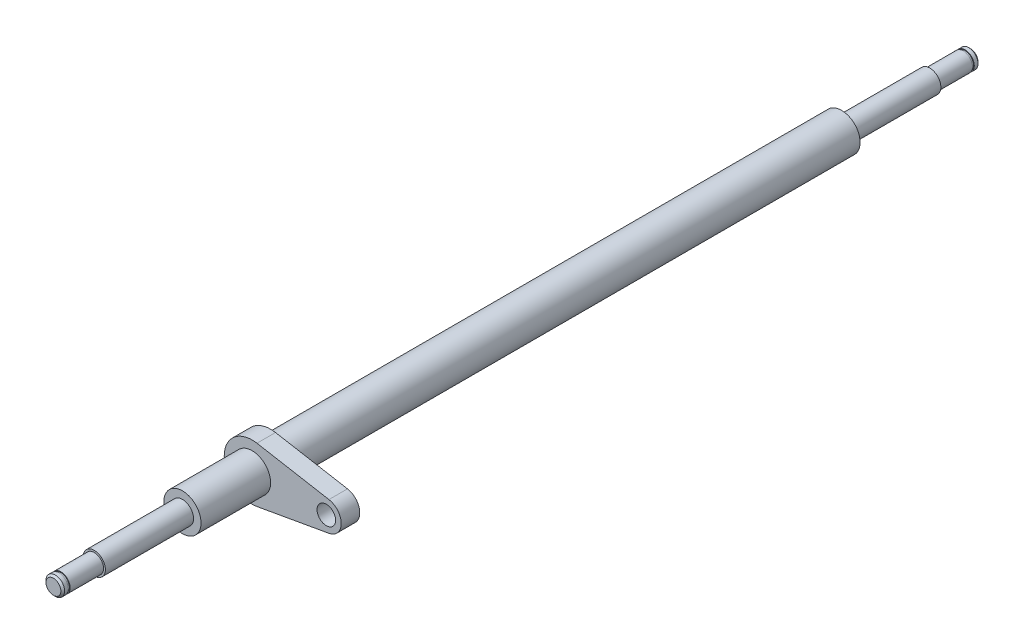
ISO-10303-21;
HEADER;
FILE_DESCRIPTION(('STEP AP214'),'2;1');
FILE_NAME('part.step','',(''),(''),'','','');
FILE_SCHEMA(('AUTOMOTIVE_DESIGN { 1 0 10303 214 1 1 1 1 }'));
ENDSEC;
DATA;
#1=APPLICATION_CONTEXT('core data for automotive mechanical design processes');
#2=APPLICATION_PROTOCOL_DEFINITION('international standard','automotive_design',2000,#1);
#3=PRODUCT_CONTEXT('',#1,'mechanical');
#4=PRODUCT('Part','Part','',(#3));
#5=PRODUCT_RELATED_PRODUCT_CATEGORY('part','',(#4));
#6=PRODUCT_DEFINITION_FORMATION('','',#4);
#7=PRODUCT_DEFINITION_CONTEXT('part definition',#1,'design');
#8=PRODUCT_DEFINITION('design','',#6,#7);
#9=PRODUCT_DEFINITION_SHAPE('','',#8);
#10=(LENGTH_UNIT() NAMED_UNIT(*) SI_UNIT(.MILLI.,.METRE.));
#11=(NAMED_UNIT(*) PLANE_ANGLE_UNIT() SI_UNIT($,.RADIAN.));
#12=(NAMED_UNIT(*) SI_UNIT($,.STERADIAN.) SOLID_ANGLE_UNIT());
#13=UNCERTAINTY_MEASURE_WITH_UNIT(LENGTH_MEASURE(1.E-05),#10,'distance_accuracy_value','');
#14=(GEOMETRIC_REPRESENTATION_CONTEXT(3) GLOBAL_UNCERTAINTY_ASSIGNED_CONTEXT((#13)) GLOBAL_UNIT_ASSIGNED_CONTEXT((#10,
#11,#12)) REPRESENTATION_CONTEXT('',''));
#15=CARTESIAN_POINT('',(0.,0.,0.));
#16=DIRECTION('',(0.,0.,1.));
#17=DIRECTION('',(1.,0.,0.));
#18=AXIS2_PLACEMENT_3D('',#15,#16,#17);
#19=CARTESIAN_POINT('',(0.,0.,140.));
#20=DIRECTION('',(0.,0.,1.));
#21=DIRECTION('',(1.,0.,0.));
#22=AXIS2_PLACEMENT_3D('',#19,#20,#21);
#23=PLANE('',#22);
#24=CARTESIAN_POINT('',(0.,0.,140.));
#25=DIRECTION('',(0.,0.,1.));
#26=DIRECTION('',(1.,0.,0.));
#27=AXIS2_PLACEMENT_3D('',#24,#25,#26);
#28=CIRCLE('',#27,10.);
#29=CARTESIAN_POINT('',(10.,0.,140.));
#30=VERTEX_POINT('',#29);
#31=EDGE_CURVE('E110',#30,#30,#28,.T.);
#32=ORIENTED_EDGE('',*,*,#31,.F.);
#33=EDGE_LOOP('',(#32));
#34=FACE_BOUND('',#33,.T.);
#35=CARTESIAN_POINT('',(0.,0.,140.));
#36=DIRECTION('',(0.,0.,1.));
#37=DIRECTION('',(1.,0.,0.));
#38=AXIS2_PLACEMENT_3D('',#35,#36,#37);
#39=CIRCLE('',#38,15.);
#40=CARTESIAN_POINT('',(2.62499999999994,14.7685265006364,140.));
#41=VERTEX_POINT('',#40);
#42=CARTESIAN_POINT('',(2.62500000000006,-14.7685265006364,140.));
#43=VERTEX_POINT('',#42);
#44=EDGE_CURVE('E95',#41,#43,#39,.T.);
#45=ORIENTED_EDGE('',*,*,#44,.T.);
#46=DIRECTION('',(0.98456843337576,0.175000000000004,0.));
#47=VECTOR('',#46,1.);
#48=CARTESIAN_POINT('',(2.62500000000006,-14.7685265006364,140.));
#49=LINE('',#48,#47);
#50=CARTESIAN_POINT('',(41.4,-7.87654746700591,140.));
#51=VERTEX_POINT('',#50);
#52=EDGE_CURVE('E90',#43,#51,#49,.T.);
#53=ORIENTED_EDGE('',*,*,#52,.T.);
#54=CARTESIAN_POINT('',(40.,1.59594559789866E-13,140.));
#55=DIRECTION('',(0.,0.,1.));
#56=DIRECTION('',(1.,0.,0.));
#57=AXIS2_PLACEMENT_3D('',#54,#55,#56);
#58=CIRCLE('',#57,7.99999999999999);
#59=CARTESIAN_POINT('',(41.4,7.87654746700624,140.));
#60=VERTEX_POINT('',#59);
#61=EDGE_CURVE('E93',#51,#60,#58,.T.);
#62=ORIENTED_EDGE('',*,*,#61,.T.);
#63=DIRECTION('',(-0.984568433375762,0.174999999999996,0.));
#64=VECTOR('',#63,1.);
#65=CARTESIAN_POINT('',(41.4,7.87654746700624,140.));
#66=LINE('',#65,#64);
#67=EDGE_CURVE('E60',#60,#41,#66,.T.);
#68=ORIENTED_EDGE('',*,*,#67,.T.);
#69=EDGE_LOOP('',(#45,#53,#62,#68));
#70=FACE_BOUND('',#69,.T.);
#71=CARTESIAN_POINT('',(40.,1.59594559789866E-13,140.));
#72=DIRECTION('',(0.,0.,1.));
#73=DIRECTION('',(1.,0.,0.));
#74=AXIS2_PLACEMENT_3D('',#71,#72,#73);
#75=CIRCLE('',#74,5.);
#76=CARTESIAN_POINT('',(45.,1.59594559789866E-13,140.));
#77=VERTEX_POINT('',#76);
#78=EDGE_CURVE('E125',#77,#77,#75,.T.);
#79=ORIENTED_EDGE('',*,*,#78,.F.);
#80=EDGE_LOOP('',(#79));
#81=FACE_BOUND('',#80,.T.);
#82=ADVANCED_FACE('F43',(#34,#70,#81),#23,.T.);
#83=CARTESIAN_POINT('',(0.,0.,130.));
#84=DIRECTION('',(0.,0.,1.));
#85=DIRECTION('',(1.,0.,0.));
#86=AXIS2_PLACEMENT_3D('',#83,#84,#85);
#87=PLANE('',#86);
#88=CARTESIAN_POINT('',(0.,0.,130.));
#89=DIRECTION('',(0.,0.,1.));
#90=DIRECTION('',(1.,0.,0.));
#91=AXIS2_PLACEMENT_3D('',#88,#89,#90);
#92=CIRCLE('',#91,10.);
#93=CARTESIAN_POINT('',(10.,0.,130.));
#94=VERTEX_POINT('',#93);
#95=EDGE_CURVE('E122',#94,#94,#92,.T.);
#96=ORIENTED_EDGE('',*,*,#95,.T.);
#97=EDGE_LOOP('',(#96));
#98=FACE_BOUND('',#97,.T.);
#99=CARTESIAN_POINT('',(0.,0.,130.));
#100=DIRECTION('',(0.,0.,1.));
#101=DIRECTION('',(1.,0.,0.));
#102=AXIS2_PLACEMENT_3D('',#99,#100,#101);
#103=CIRCLE('',#102,15.);
#104=CARTESIAN_POINT('',(2.62499999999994,14.7685265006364,130.));
#105=VERTEX_POINT('',#104);
#106=CARTESIAN_POINT('',(2.62500000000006,-14.7685265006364,130.));
#107=VERTEX_POINT('',#106);
#108=EDGE_CURVE('E107',#105,#107,#103,.T.);
#109=ORIENTED_EDGE('',*,*,#108,.F.);
#110=DIRECTION('',(-0.984568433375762,0.174999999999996,0.));
#111=VECTOR('',#110,1.);
#112=CARTESIAN_POINT('',(41.4,7.87654746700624,130.));
#113=LINE('',#112,#111);
#114=CARTESIAN_POINT('',(41.4,7.87654746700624,130.));
#115=VERTEX_POINT('',#114);
#116=EDGE_CURVE('E83',#115,#105,#113,.T.);
#117=ORIENTED_EDGE('',*,*,#116,.F.);
#118=CARTESIAN_POINT('',(40.,1.59594559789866E-13,130.));
#119=DIRECTION('',(0.,0.,1.));
#120=DIRECTION('',(1.,0.,0.));
#121=AXIS2_PLACEMENT_3D('',#118,#119,#120);
#122=CIRCLE('',#121,7.99999999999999);
#123=CARTESIAN_POINT('',(41.4,-7.87654746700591,130.));
#124=VERTEX_POINT('',#123);
#125=EDGE_CURVE('E77',#124,#115,#122,.T.);
#126=ORIENTED_EDGE('',*,*,#125,.F.);
#127=DIRECTION('',(0.98456843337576,0.175000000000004,0.));
#128=VECTOR('',#127,1.);
#129=CARTESIAN_POINT('',(2.62500000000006,-14.7685265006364,130.));
#130=LINE('',#129,#128);
#131=EDGE_CURVE('E99',#107,#124,#130,.T.);
#132=ORIENTED_EDGE('',*,*,#131,.F.);
#133=EDGE_LOOP('',(#109,#117,#126,#132));
#134=FACE_BOUND('',#133,.T.);
#135=CARTESIAN_POINT('',(40.,1.59594559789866E-13,130.));
#136=DIRECTION('',(0.,0.,1.));
#137=DIRECTION('',(1.,0.,0.));
#138=AXIS2_PLACEMENT_3D('',#135,#136,#137);
#139=CIRCLE('',#138,5.);
#140=CARTESIAN_POINT('',(45.,1.59594559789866E-13,130.));
#141=VERTEX_POINT('',#140);
#142=EDGE_CURVE('E128',#141,#141,#139,.T.);
#143=ORIENTED_EDGE('',*,*,#142,.T.);
#144=EDGE_LOOP('',(#143));
#145=FACE_BOUND('',#144,.T.);
#146=ADVANCED_FACE('F118',(#98,#134,#145),#87,.F.);
#147=CARTESIAN_POINT('',(0.,0.,140.));
#148=DIRECTION('',(0.,0.,-1.));
#149=DIRECTION('',(-1.,0.,0.));
#150=AXIS2_PLACEMENT_3D('',#147,#148,#149);
#151=CYLINDRICAL_SURFACE('',#150,15.);
#152=ORIENTED_EDGE('',*,*,#108,.T.);
#153=DIRECTION('',(0.,0.,-1.));
#154=VECTOR('',#153,1.);
#155=CARTESIAN_POINT('',(2.62500000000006,-14.7685265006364,140.));
#156=LINE('',#155,#154);
#157=EDGE_CURVE('E12',#43,#107,#156,.T.);
#158=ORIENTED_EDGE('',*,*,#157,.F.);
#159=ORIENTED_EDGE('',*,*,#44,.F.);
#160=DIRECTION('',(0.,0.,-1.));
#161=VECTOR('',#160,1.);
#162=CARTESIAN_POINT('',(2.62499999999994,14.7685265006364,140.));
#163=LINE('',#162,#161);
#164=EDGE_CURVE('E103',#41,#105,#163,.T.);
#165=ORIENTED_EDGE('',*,*,#164,.T.);
#166=EDGE_LOOP('',(#152,#158,#159,#165));
#167=FACE_BOUND('',#166,.T.);
#168=ADVANCED_FACE('F45',(#167),#151,.T.);
#169=CARTESIAN_POINT('',(2.62500000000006,-14.7685265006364,140.));
#170=DIRECTION('',(-0.175000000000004,0.98456843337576,0.));
#171=DIRECTION('',(-0.98456843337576,-0.175000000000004,0.));
#172=AXIS2_PLACEMENT_3D('',#169,#170,#171);
#173=PLANE('',#172);
#174=ORIENTED_EDGE('',*,*,#131,.T.);
#175=DIRECTION('',(0.,0.,-1.));
#176=VECTOR('',#175,1.);
#177=CARTESIAN_POINT('',(41.4,-7.87654746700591,140.));
#178=LINE('',#177,#176);
#179=EDGE_CURVE('E52',#51,#124,#178,.T.);
#180=ORIENTED_EDGE('',*,*,#179,.F.);
#181=ORIENTED_EDGE('',*,*,#52,.F.);
#182=ORIENTED_EDGE('',*,*,#157,.T.);
#183=EDGE_LOOP('',(#174,#180,#181,#182));
#184=FACE_BOUND('',#183,.T.);
#185=ADVANCED_FACE('F98',(#184),#173,.F.);
#186=CARTESIAN_POINT('',(40.,1.59594559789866E-13,140.));
#187=DIRECTION('',(0.,0.,-1.));
#188=DIRECTION('',(-1.,0.,0.));
#189=AXIS2_PLACEMENT_3D('',#186,#187,#188);
#190=CYLINDRICAL_SURFACE('',#189,7.99999999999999);
#191=ORIENTED_EDGE('',*,*,#125,.T.);
#192=DIRECTION('',(0.,0.,-1.));
#193=VECTOR('',#192,1.);
#194=CARTESIAN_POINT('',(41.4,7.87654746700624,140.));
#195=LINE('',#194,#193);
#196=EDGE_CURVE('E100',#60,#115,#195,.T.);
#197=ORIENTED_EDGE('',*,*,#196,.F.);
#198=ORIENTED_EDGE('',*,*,#61,.F.);
#199=ORIENTED_EDGE('',*,*,#179,.T.);
#200=EDGE_LOOP('',(#191,#197,#198,#199));
#201=FACE_BOUND('',#200,.T.);
#202=ADVANCED_FACE('F101',(#201),#190,.T.);
#203=CARTESIAN_POINT('',(41.4,7.87654746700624,140.));
#204=DIRECTION('',(-0.174999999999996,-0.984568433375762,0.));
#205=DIRECTION('',(0.984568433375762,-0.174999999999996,0.));
#206=AXIS2_PLACEMENT_3D('',#203,#204,#205);
#207=PLANE('',#206);
#208=ORIENTED_EDGE('',*,*,#116,.T.);
#209=ORIENTED_EDGE('',*,*,#164,.F.);
#210=ORIENTED_EDGE('',*,*,#67,.F.);
#211=ORIENTED_EDGE('',*,*,#196,.T.);
#212=EDGE_LOOP('',(#208,#209,#210,#211));
#213=FACE_BOUND('',#212,.T.);
#214=ADVANCED_FACE('F115',(#213),#207,.F.);
#215=CARTESIAN_POINT('',(0.,0.,140.));
#216=DIRECTION('',(0.,0.,-1.));
#217=DIRECTION('',(-1.,0.,0.));
#218=AXIS2_PLACEMENT_3D('',#215,#216,#217);
#219=CYLINDRICAL_SURFACE('',#218,10.);
#220=ORIENTED_EDGE('',*,*,#31,.T.);
#221=EDGE_LOOP('',(#220));
#222=FACE_BOUND('',#221,.T.);
#223=ORIENTED_EDGE('',*,*,#95,.F.);
#224=EDGE_LOOP('',(#223));
#225=FACE_BOUND('',#224,.T.);
#226=ADVANCED_FACE('F146',(#222,#225),#219,.F.);
#227=CARTESIAN_POINT('',(40.,1.59594559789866E-13,140.));
#228=DIRECTION('',(0.,0.,-1.));
#229=DIRECTION('',(-1.,0.,0.));
#230=AXIS2_PLACEMENT_3D('',#227,#228,#229);
#231=CYLINDRICAL_SURFACE('',#230,5.);
#232=ORIENTED_EDGE('',*,*,#78,.T.);
#233=EDGE_LOOP('',(#232));
#234=FACE_BOUND('',#233,.T.);
#235=ORIENTED_EDGE('',*,*,#142,.F.);
#236=EDGE_LOOP('',(#235));
#237=FACE_BOUND('',#236,.T.);
#238=ADVANCED_FACE('F134',(#234,#237),#231,.F.);
#239=CLOSED_SHELL('',(#82,#146,#168,#185,#202,#214,#226,#238));
#240=MANIFOLD_SOLID_BREP('B2',#239);
#241=CARTESIAN_POINT('',(0.,0.,0.));
#242=DIRECTION('',(0.,0.,-1.));
#243=DIRECTION('',(-1.,0.,0.));
#244=AXIS2_PLACEMENT_3D('',#241,#242,#243);
#245=CYLINDRICAL_SURFACE('',#244,4.99999999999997);
#246=CARTESIAN_POINT('',(0.,0.,243.));
#247=DIRECTION('',(0.,0.,-1.));
#248=DIRECTION('',(-1.,0.,0.));
#249=AXIS2_PLACEMENT_3D('',#246,#247,#248);
#250=CIRCLE('',#249,4.99999999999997);
#251=CARTESIAN_POINT('',(-4.99999999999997,0.,243.));
#252=VERTEX_POINT('',#251);
#253=EDGE_CURVE('E416',#252,#252,#250,.T.);
#254=ORIENTED_EDGE('',*,*,#253,.T.);
#255=EDGE_LOOP('',(#254));
#256=FACE_BOUND('',#255,.T.);
#257=CARTESIAN_POINT('',(0.,0.,225.));
#258=DIRECTION('',(0.,0.,-1.));
#259=DIRECTION('',(-1.,0.,0.));
#260=AXIS2_PLACEMENT_3D('',#257,#258,#259);
#261=CIRCLE('',#260,4.99999999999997);
#262=CARTESIAN_POINT('',(-4.99999999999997,0.,225.));
#263=VERTEX_POINT('',#262);
#264=EDGE_CURVE('E412',#263,#263,#261,.T.);
#265=ORIENTED_EDGE('',*,*,#264,.F.);
#266=EDGE_LOOP('',(#265));
#267=FACE_BOUND('',#266,.T.);
#268=DIRECTION('',(0.,0.,-1.));
#269=VECTOR('',#268,1.);
#270=CARTESIAN_POINT('',(-4.58257569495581,-2.,0.));
#271=LINE('',#270,#269);
#272=CARTESIAN_POINT('',(-4.58257569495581,-2.,240.));
#273=VERTEX_POINT('',#272);
#274=CARTESIAN_POINT('',(-4.58257569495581,-2.,228.));
#275=VERTEX_POINT('',#274);
#276=EDGE_CURVE('E217',#273,#275,#271,.T.);
#277=ORIENTED_EDGE('',*,*,#276,.T.);
#278=CARTESIAN_POINT('',(-4.58257569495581,-2.,228.));
#279=CARTESIAN_POINT('',(-4.58256464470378,-2.00000798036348,227.946194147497));
#280=CARTESIAN_POINT('',(-4.5835230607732,-1.99782891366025,227.892394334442));
#281=CARTESIAN_POINT('',(-4.5872962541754,-1.98915905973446,227.785228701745));
#282=CARTESIAN_POINT('',(-4.59011032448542,-1.98266991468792,227.731862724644));
#283=CARTESIAN_POINT('',(-4.59749782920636,-1.9654760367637,227.626153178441));
#284=CARTESIAN_POINT('',(-4.6020643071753,-1.95478796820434,227.573806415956));
#285=CARTESIAN_POINT('',(-4.61280053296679,-1.9293163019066,227.470299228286));
#286=CARTESIAN_POINT('',(-4.61897037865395,-1.9145324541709,227.419138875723));
#287=CARTESIAN_POINT('',(-4.63959291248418,-1.86426971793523,227.268064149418));
#288=CARTESIAN_POINT('',(-4.65617449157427,-1.82284489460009,227.17034576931));
#289=CARTESIAN_POINT('',(-4.69312370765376,-1.72548191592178,226.983204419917));
#290=CARTESIAN_POINT('',(-4.71349493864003,-1.66952996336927,226.893789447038));
#291=CARTESIAN_POINT('',(-4.75700999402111,-1.54131835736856,226.720737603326));
#292=CARTESIAN_POINT('',(-4.78024245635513,-1.46836913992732,226.63763278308));
#293=CARTESIAN_POINT('',(-4.82612790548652,-1.30969646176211,226.484459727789));
#294=CARTESIAN_POINT('',(-4.84878077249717,-1.22397038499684,226.414394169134));
#295=CARTESIAN_POINT('',(-4.89203417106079,-1.03800590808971,226.286593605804));
#296=CARTESIAN_POINT('',(-4.91251824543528,-0.937327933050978,226.229455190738));
#297=CARTESIAN_POINT('',(-4.94803944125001,-0.726824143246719,226.133155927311));
#298=CARTESIAN_POINT('',(-4.96307883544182,-0.617002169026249,226.093987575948));
#299=CARTESIAN_POINT('',(-4.98538314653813,-0.39696744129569,226.036658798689));
#300=CARTESIAN_POINT('',(-4.99298922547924,-0.287031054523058,226.017573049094));
#301=CARTESIAN_POINT('',(-5.00080310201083,-0.065268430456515,225.997971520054));
#302=CARTESIAN_POINT('',(-5.00101352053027,0.0465571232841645,225.997449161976));
#303=CARTESIAN_POINT('',(-4.99421960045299,0.26223337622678,226.01448283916));
#304=CARTESIAN_POINT('',(-4.98761985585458,0.366179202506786,226.031025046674));
#305=CARTESIAN_POINT('',(-4.96849270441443,0.569674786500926,226.079993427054));
#306=CARTESIAN_POINT('',(-4.95596496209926,0.669224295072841,226.112420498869));
#307=CARTESIAN_POINT('',(-4.92596830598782,0.862897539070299,226.192636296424));
#308=CARTESIAN_POINT('',(-4.90842774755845,0.956916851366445,226.24064924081));
#309=CARTESIAN_POINT('',(-4.8701460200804,1.13580746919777,226.350464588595));
#310=CARTESIAN_POINT('',(-4.84940372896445,1.22067554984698,226.412271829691));
#311=CARTESIAN_POINT('',(-4.80521782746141,1.38476339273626,226.552644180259));
#312=CARTESIAN_POINT('',(-4.78168627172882,1.46324770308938,226.63204247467));
#313=CARTESIAN_POINT('',(-4.73561950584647,1.60609926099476,226.802980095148));
#314=CARTESIAN_POINT('',(-4.7130847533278,1.67046007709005,226.894524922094));
#315=CARTESIAN_POINT('',(-4.67095688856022,1.78493657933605,227.090470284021));
#316=CARTESIAN_POINT('',(-4.6514670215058,1.83458932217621,227.19516483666));
#317=CARTESIAN_POINT('',(-4.61886105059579,1.91521298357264,227.412361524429));
#318=CARTESIAN_POINT('',(-4.60573367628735,1.94621696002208,227.524849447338));
#319=CARTESIAN_POINT('',(-4.5920830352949,1.9781058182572,227.698743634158));
#320=CARTESIAN_POINT('',(-4.58853437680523,1.98630505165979,227.758657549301));
#321=CARTESIAN_POINT('',(-4.58377540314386,1.99725282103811,227.879035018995));
#322=CARTESIAN_POINT('',(-4.58256364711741,2.00000471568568,227.939498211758));
#323=CARTESIAN_POINT('',(-4.58257569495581,2.,228.));
#324=B_SPLINE_CURVE_WITH_KNOTS('',3,(#278,#279,#280,#281,#282,#283,#284,#285,#286,#287,#288,
#289,#290,#291,#292,#293,#294,#295,#296,#297,#298,#299,#300,#301,#302,#303,#304,#305,#306,#307,
#308,#309,#310,#311,#312,#313,#314,#315,#316,#317,#318,#319,#320,#321,#322,#323),.UNSPECIFIED.,
.F.,.F.,(4,2,2,2,2,2,2,2,2,2,2,2,2,2,2,2,2,2,2,2,2,2,4),(0.,0.161354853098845,0.322648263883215,
0.483307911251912,0.643977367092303,0.964683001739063,1.28569434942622,1.62318047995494,
1.96073580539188,2.31162858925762,2.66237473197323,2.9961387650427,3.32978451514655,
3.64468915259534,3.95961161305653,4.27928176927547,4.59906421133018,4.93981874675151,
5.28072813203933,5.6314424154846,5.98153315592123,6.16300192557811,6.34435877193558),.UNSPECIFIED.);
#325=CARTESIAN_POINT('',(-4.58257569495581,2.,228.));
#326=VERTEX_POINT('',#325);
#327=EDGE_CURVE('E377',#275,#326,#324,.T.);
#328=ORIENTED_EDGE('',*,*,#327,.T.);
#329=DIRECTION('',(0.,0.,-1.));
#330=VECTOR('',#329,1.);
#331=CARTESIAN_POINT('',(-4.58257569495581,2.,0.));
#332=LINE('',#331,#330);
#333=CARTESIAN_POINT('',(-4.58257569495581,2.,240.));
#334=VERTEX_POINT('',#333);
#335=EDGE_CURVE('E479',#326,#334,#332,.F.);
#336=ORIENTED_EDGE('',*,*,#335,.T.);
#337=CARTESIAN_POINT('',(-4.58257569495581,2.,240.));
#338=CARTESIAN_POINT('',(-4.58256464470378,2.00000798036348,240.053805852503));
#339=CARTESIAN_POINT('',(-4.5835230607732,1.99782891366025,240.107605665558));
#340=CARTESIAN_POINT('',(-4.5872962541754,1.98915905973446,240.214771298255));
#341=CARTESIAN_POINT('',(-4.59011032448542,1.98266991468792,240.268137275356));
#342=CARTESIAN_POINT('',(-4.59749782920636,1.9654760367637,240.373846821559));
#343=CARTESIAN_POINT('',(-4.6020643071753,1.95478796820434,240.426193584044));
#344=CARTESIAN_POINT('',(-4.61280053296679,1.9293163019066,240.529700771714));
#345=CARTESIAN_POINT('',(-4.61897037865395,1.9145324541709,240.580861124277));
#346=CARTESIAN_POINT('',(-4.63959291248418,1.86426971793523,240.731935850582));
#347=CARTESIAN_POINT('',(-4.65617449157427,1.8228448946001,240.82965423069));
#348=CARTESIAN_POINT('',(-4.69312370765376,1.72548191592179,241.016795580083));
#349=CARTESIAN_POINT('',(-4.71349493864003,1.66952996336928,241.106210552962));
#350=CARTESIAN_POINT('',(-4.75700999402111,1.54131835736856,241.279262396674));
#351=CARTESIAN_POINT('',(-4.78024245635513,1.46836913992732,241.36236721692));
#352=CARTESIAN_POINT('',(-4.82612790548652,1.30969646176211,241.515540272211));
#353=CARTESIAN_POINT('',(-4.84878077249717,1.22397038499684,241.585605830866));
#354=CARTESIAN_POINT('',(-4.89203417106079,1.0380059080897,241.713406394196));
#355=CARTESIAN_POINT('',(-4.91251824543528,0.937327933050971,241.770544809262));
#356=CARTESIAN_POINT('',(-4.94803944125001,0.726824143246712,241.866844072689));
#357=CARTESIAN_POINT('',(-4.96307883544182,0.617002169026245,241.906012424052));
#358=CARTESIAN_POINT('',(-4.98538314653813,0.39696744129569,241.963341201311));
#359=CARTESIAN_POINT('',(-4.99298922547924,0.287031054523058,241.982426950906));
#360=CARTESIAN_POINT('',(-5.00080310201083,0.0652684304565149,242.002028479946));
#361=CARTESIAN_POINT('',(-5.00101352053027,-0.0465571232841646,242.002550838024));
#362=CARTESIAN_POINT('',(-4.99421960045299,-0.26223337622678,241.98551716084));
#363=CARTESIAN_POINT('',(-4.98761985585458,-0.366179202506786,241.968974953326));
#364=CARTESIAN_POINT('',(-4.96849270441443,-0.569674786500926,241.920006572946));
#365=CARTESIAN_POINT('',(-4.95596496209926,-0.669224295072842,241.887579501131));
#366=CARTESIAN_POINT('',(-4.92596830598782,-0.862897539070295,241.807363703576));
#367=CARTESIAN_POINT('',(-4.90842774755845,-0.956916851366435,241.75935075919));
#368=CARTESIAN_POINT('',(-4.8701460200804,-1.13580746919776,241.649535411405));
#369=CARTESIAN_POINT('',(-4.84940372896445,-1.22067554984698,241.587728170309));
#370=CARTESIAN_POINT('',(-4.80521782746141,-1.38476339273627,241.447355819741));
#371=CARTESIAN_POINT('',(-4.78168627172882,-1.46324770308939,241.36795752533));
#372=CARTESIAN_POINT('',(-4.73561950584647,-1.60609926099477,241.197019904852));
#373=CARTESIAN_POINT('',(-4.7130847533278,-1.67046007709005,241.105475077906));
#374=CARTESIAN_POINT('',(-4.67095688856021,-1.78493657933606,240.909529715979));
#375=CARTESIAN_POINT('',(-4.6514670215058,-1.83458932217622,240.80483516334));
#376=CARTESIAN_POINT('',(-4.61886105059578,-1.91521298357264,240.587638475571));
#377=CARTESIAN_POINT('',(-4.60573367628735,-1.94621696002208,240.475150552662));
#378=CARTESIAN_POINT('',(-4.5920830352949,-1.9781058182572,240.301256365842));
#379=CARTESIAN_POINT('',(-4.58853437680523,-1.98630505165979,240.241342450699));
#380=CARTESIAN_POINT('',(-4.58377540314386,-1.99725282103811,240.120964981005));
#381=CARTESIAN_POINT('',(-4.58256364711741,-2.00000471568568,240.060501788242));
#382=CARTESIAN_POINT('',(-4.58257569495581,-2.,240.));
#383=B_SPLINE_CURVE_WITH_KNOTS('',3,(#337,#338,#339,#340,#341,#342,#343,#344,#345,#346,#347,
#348,#349,#350,#351,#352,#353,#354,#355,#356,#357,#358,#359,#360,#361,#362,#363,#364,#365,#366,
#367,#368,#369,#370,#371,#372,#373,#374,#375,#376,#377,#378,#379,#380,#381,#382),.UNSPECIFIED.,
.F.,.F.,(4,2,2,2,2,2,2,2,2,2,2,2,2,2,2,2,2,2,2,2,2,2,4),(0.,0.161354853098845,0.322648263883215,
0.483307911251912,0.643977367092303,0.964683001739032,1.28569434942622,1.62318047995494,
1.96073580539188,2.31162858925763,2.66237473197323,2.9961387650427,3.32978451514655,
3.64468915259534,3.95961161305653,4.27928176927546,4.59906421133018,4.93981874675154,
5.28072813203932,5.63144241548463,5.98153315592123,6.16300192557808,6.34435877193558),.UNSPECIFIED.);
#384=EDGE_CURVE('E224',#334,#273,#383,.T.);
#385=ORIENTED_EDGE('',*,*,#384,.T.);
#386=EDGE_LOOP('',(#277,#328,#336,#385));
#387=FACE_BOUND('',#386,.T.);
#388=ADVANCED_FACE('F209',(#256,#267,#387),#245,.T.);
#389=CARTESIAN_POINT('',(0.,0.,0.));
#390=DIRECTION('',(0.,0.,-1.));
#391=DIRECTION('',(-1.,0.,0.));
#392=AXIS2_PLACEMENT_3D('',#389,#390,#391);
#393=CYLINDRICAL_SURFACE('',#392,5.99999999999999);
#394=CARTESIAN_POINT('',(0.,0.,177.5));
#395=DIRECTION('',(0.,0.,1.));
#396=DIRECTION('',(1.,0.,0.));
#397=AXIS2_PLACEMENT_3D('',#394,#395,#396);
#398=CIRCLE('',#397,5.99999999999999);
#399=CARTESIAN_POINT('',(5.99999999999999,0.,177.5));
#400=VERTEX_POINT('',#399);
#401=EDGE_CURVE('E41',#400,#400,#398,.F.);
#402=ORIENTED_EDGE('',*,*,#401,.F.);
#403=EDGE_LOOP('',(#402));
#404=FACE_BOUND('',#403,.T.);
#405=CARTESIAN_POINT('',(0.,0.,225.));
#406=DIRECTION('',(0.,0.,-1.));
#407=DIRECTION('',(-1.,0.,0.));
#408=AXIS2_PLACEMENT_3D('',#405,#406,#407);
#409=CIRCLE('',#408,5.99999999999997);
#410=CARTESIAN_POINT('',(-5.99999999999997,0.,225.));
#411=VERTEX_POINT('',#410);
#412=EDGE_CURVE('E385',#411,#411,#409,.T.);
#413=ORIENTED_EDGE('',*,*,#412,.T.);
#414=EDGE_LOOP('',(#413));
#415=FACE_BOUND('',#414,.T.);
#416=ADVANCED_FACE('F211',(#404,#415),#393,.T.);
#417=CARTESIAN_POINT('',(0.,5.99999999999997,225.));
#418=DIRECTION('',(0.,0.,1.));
#419=DIRECTION('',(1.,0.,0.));
#420=AXIS2_PLACEMENT_3D('',#417,#418,#419);
#421=PLANE('',#420);
#422=ORIENTED_EDGE('',*,*,#264,.T.);
#423=EDGE_LOOP('',(#422));
#424=FACE_BOUND('',#423,.T.);
#425=ORIENTED_EDGE('',*,*,#412,.F.);
#426=EDGE_LOOP('',(#425));
#427=FACE_BOUND('',#426,.T.);
#428=ADVANCED_FACE('F397',(#424,#427),#421,.T.);
#429=CARTESIAN_POINT('',(0.,4.99999999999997,243.));
#430=DIRECTION('',(0.,0.,1.));
#431=DIRECTION('',(1.,0.,0.));
#432=AXIS2_PLACEMENT_3D('',#429,#430,#431);
#433=PLANE('',#432);
#434=CARTESIAN_POINT('',(0.,0.,243.));
#435=DIRECTION('',(0.,0.,-1.));
#436=DIRECTION('',(-1.,0.,0.));
#437=AXIS2_PLACEMENT_3D('',#434,#435,#436);
#438=CIRCLE('',#437,4.59999999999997);
#439=CARTESIAN_POINT('',(-4.59999999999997,0.,243.));
#440=VERTEX_POINT('',#439);
#441=EDGE_CURVE('E418',#440,#440,#438,.T.);
#442=ORIENTED_EDGE('',*,*,#441,.T.);
#443=EDGE_LOOP('',(#442));
#444=FACE_BOUND('',#443,.T.);
#445=ORIENTED_EDGE('',*,*,#253,.F.);
#446=EDGE_LOOP('',(#445));
#447=FACE_BOUND('',#446,.T.);
#448=ADVANCED_FACE('F395',(#444,#447),#433,.T.);
#449=CARTESIAN_POINT('',(0.,0.,0.));
#450=DIRECTION('',(0.,0.,-1.));
#451=DIRECTION('',(-1.,0.,0.));
#452=AXIS2_PLACEMENT_3D('',#449,#450,#451);
#453=CYLINDRICAL_SURFACE('',#452,4.59999999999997);
#454=CARTESIAN_POINT('',(0.,0.,244.));
#455=DIRECTION('',(0.,0.,-1.));
#456=DIRECTION('',(-1.,0.,0.));
#457=AXIS2_PLACEMENT_3D('',#454,#455,#456);
#458=CIRCLE('',#457,4.59999999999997);
#459=CARTESIAN_POINT('',(-4.59999999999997,0.,244.));
#460=VERTEX_POINT('',#459);
#461=EDGE_CURVE('E423',#460,#460,#458,.T.);
#462=ORIENTED_EDGE('',*,*,#461,.T.);
#463=EDGE_LOOP('',(#462));
#464=FACE_BOUND('',#463,.T.);
#465=ORIENTED_EDGE('',*,*,#441,.F.);
#466=EDGE_LOOP('',(#465));
#467=FACE_BOUND('',#466,.T.);
#468=ADVANCED_FACE('F405',(#464,#467),#453,.T.);
#469=CARTESIAN_POINT('',(0.,4.59999999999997,244.));
#470=DIRECTION('',(0.,0.,-1.));
#471=DIRECTION('',(-1.,0.,0.));
#472=AXIS2_PLACEMENT_3D('',#469,#470,#471);
#473=PLANE('',#472);
#474=CARTESIAN_POINT('',(0.,0.,244.));
#475=DIRECTION('',(0.,0.,-1.));
#476=DIRECTION('',(-1.,0.,0.));
#477=AXIS2_PLACEMENT_3D('',#474,#475,#476);
#478=CIRCLE('',#477,4.99999999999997);
#479=CARTESIAN_POINT('',(-4.99999999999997,0.,244.));
#480=VERTEX_POINT('',#479);
#481=EDGE_CURVE('E426',#480,#480,#478,.T.);
#482=ORIENTED_EDGE('',*,*,#481,.T.);
#483=EDGE_LOOP('',(#482));
#484=FACE_BOUND('',#483,.T.);
#485=ORIENTED_EDGE('',*,*,#461,.F.);
#486=EDGE_LOOP('',(#485));
#487=FACE_BOUND('',#486,.T.);
#488=ADVANCED_FACE('F505',(#484,#487),#473,.T.);
#489=CARTESIAN_POINT('',(0.,0.,0.));
#490=DIRECTION('',(0.,0.,-1.));
#491=DIRECTION('',(-1.,0.,0.));
#492=AXIS2_PLACEMENT_3D('',#489,#490,#491);
#493=CYLINDRICAL_SURFACE('',#492,4.99999999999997);
#494=CARTESIAN_POINT('',(0.,0.,246.));
#495=DIRECTION('',(0.,0.,-1.));
#496=DIRECTION('',(-1.,0.,0.));
#497=AXIS2_PLACEMENT_3D('',#494,#495,#496);
#498=CIRCLE('',#497,4.99999999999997);
#499=CARTESIAN_POINT('',(-4.99999999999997,0.,246.));
#500=VERTEX_POINT('',#499);
#501=EDGE_CURVE('E429',#500,#500,#498,.T.);
#502=ORIENTED_EDGE('',*,*,#501,.T.);
#503=EDGE_LOOP('',(#502));
#504=FACE_BOUND('',#503,.T.);
#505=ORIENTED_EDGE('',*,*,#481,.F.);
#506=EDGE_LOOP('',(#505));
#507=FACE_BOUND('',#506,.T.);
#508=ADVANCED_FACE('F501',(#504,#507),#493,.T.);
#509=CARTESIAN_POINT('',(0.,0.,246.));
#510=DIRECTION('',(0.,0.,-1.));
#511=DIRECTION('',(-1.,0.,0.));
#512=AXIS2_PLACEMENT_3D('',#509,#510,#511);
#513=CONICAL_SURFACE('',#512,4.99999999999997,0.785398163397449);
#514=CARTESIAN_POINT('',(0.,0.,247.));
#515=DIRECTION('',(0.,0.,-1.));
#516=DIRECTION('',(-1.,0.,0.));
#517=AXIS2_PLACEMENT_3D('',#514,#515,#516);
#518=CIRCLE('',#517,3.99999999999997);
#519=CARTESIAN_POINT('',(-3.99999999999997,0.,247.));
#520=VERTEX_POINT('',#519);
#521=EDGE_CURVE('E432',#520,#520,#518,.T.);
#522=ORIENTED_EDGE('',*,*,#521,.T.);
#523=EDGE_LOOP('',(#522));
#524=FACE_BOUND('',#523,.T.);
#525=ORIENTED_EDGE('',*,*,#501,.F.);
#526=EDGE_LOOP('',(#525));
#527=FACE_BOUND('',#526,.T.);
#528=ADVANCED_FACE('F494',(#524,#527),#513,.T.);
#529=CARTESIAN_POINT('',(0.,3.99999999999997,247.));
#530=DIRECTION('',(0.,0.,1.));
#531=DIRECTION('',(1.,0.,0.));
#532=AXIS2_PLACEMENT_3D('',#529,#530,#531);
#533=PLANE('',#532);
#534=ORIENTED_EDGE('',*,*,#521,.F.);
#535=EDGE_LOOP('',(#534));
#536=FACE_BOUND('',#535,.T.);
#537=ADVANCED_FACE('F489',(#536),#533,.T.);
#538=CARTESIAN_POINT('',(-2.6,0.,240.));
#539=DIRECTION('',(-1.,0.,0.));
#540=DIRECTION('',(0.,0.,1.));
#541=AXIS2_PLACEMENT_3D('',#538,#539,#540);
#542=CYLINDRICAL_SURFACE('',#541,2.);
#543=DIRECTION('',(-1.,0.,0.));
#544=VECTOR('',#543,1.);
#545=CARTESIAN_POINT('',(-2.6,2.,240.));
#546=LINE('',#545,#544);
#547=CARTESIAN_POINT('',(-2.6,2.,240.));
#548=VERTEX_POINT('',#547);
#549=EDGE_CURVE('E442',#548,#334,#546,.T.);
#550=ORIENTED_EDGE('',*,*,#549,.F.);
#551=CARTESIAN_POINT('',(-2.6,0.,240.));
#552=DIRECTION('',(1.,0.,0.));
#553=DIRECTION('',(0.,0.,-1.));
#554=AXIS2_PLACEMENT_3D('',#551,#552,#553);
#555=CIRCLE('',#554,2.);
#556=CARTESIAN_POINT('',(-2.6,-2.,240.));
#557=VERTEX_POINT('',#556);
#558=EDGE_CURVE('E450',#548,#557,#555,.T.);
#559=ORIENTED_EDGE('',*,*,#558,.T.);
#560=DIRECTION('',(-1.,0.,0.));
#561=VECTOR('',#560,1.);
#562=CARTESIAN_POINT('',(-2.6,-2.,240.));
#563=LINE('',#562,#561);
#564=EDGE_CURVE('E435',#557,#273,#563,.T.);
#565=ORIENTED_EDGE('',*,*,#564,.T.);
#566=ORIENTED_EDGE('',*,*,#384,.F.);
#567=EDGE_LOOP('',(#550,#559,#565,#566));
#568=FACE_BOUND('',#567,.T.);
#569=ADVANCED_FACE('F487',(#568),#542,.F.);
#570=CARTESIAN_POINT('',(-2.6,-2.,240.));
#571=DIRECTION('',(0.,1.,0.));
#572=DIRECTION('',(0.,0.,1.));
#573=AXIS2_PLACEMENT_3D('',#570,#571,#572);
#574=PLANE('',#573);
#575=ORIENTED_EDGE('',*,*,#564,.F.);
#576=DIRECTION('',(0.,0.,-1.));
#577=VECTOR('',#576,1.);
#578=CARTESIAN_POINT('',(-2.6,-2.,240.));
#579=LINE('',#578,#577);
#580=CARTESIAN_POINT('',(-2.6,-2.,228.));
#581=VERTEX_POINT('',#580);
#582=EDGE_CURVE('E448',#557,#581,#579,.T.);
#583=ORIENTED_EDGE('',*,*,#582,.T.);
#584=DIRECTION('',(-1.,0.,0.));
#585=VECTOR('',#584,1.);
#586=CARTESIAN_POINT('',(-2.6,-2.,228.));
#587=LINE('',#586,#585);
#588=EDGE_CURVE('E437',#581,#275,#587,.T.);
#589=ORIENTED_EDGE('',*,*,#588,.T.);
#590=ORIENTED_EDGE('',*,*,#276,.F.);
#591=EDGE_LOOP('',(#575,#583,#589,#590));
#592=FACE_BOUND('',#591,.T.);
#593=ADVANCED_FACE('F373',(#592),#574,.T.);
#594=CARTESIAN_POINT('',(-2.6,0.,228.));
#595=DIRECTION('',(-1.,0.,0.));
#596=DIRECTION('',(0.,0.,1.));
#597=AXIS2_PLACEMENT_3D('',#594,#595,#596);
#598=CYLINDRICAL_SURFACE('',#597,2.);
#599=ORIENTED_EDGE('',*,*,#588,.F.);
#600=CARTESIAN_POINT('',(-2.6,0.,228.));
#601=DIRECTION('',(1.,0.,0.));
#602=DIRECTION('',(0.,0.,-1.));
#603=AXIS2_PLACEMENT_3D('',#600,#601,#602);
#604=CIRCLE('',#603,2.);
#605=CARTESIAN_POINT('',(-2.6,2.,228.));
#606=VERTEX_POINT('',#605);
#607=EDGE_CURVE('E446',#581,#606,#604,.T.);
#608=ORIENTED_EDGE('',*,*,#607,.T.);
#609=DIRECTION('',(-1.,0.,0.));
#610=VECTOR('',#609,1.);
#611=CARTESIAN_POINT('',(-2.6,2.,228.));
#612=LINE('',#611,#610);
#613=EDGE_CURVE('E439',#606,#326,#612,.T.);
#614=ORIENTED_EDGE('',*,*,#613,.T.);
#615=ORIENTED_EDGE('',*,*,#327,.F.);
#616=EDGE_LOOP('',(#599,#608,#614,#615));
#617=FACE_BOUND('',#616,.T.);
#618=ADVANCED_FACE('F368',(#617),#598,.F.);
#619=CARTESIAN_POINT('',(-2.6,2.,240.));
#620=DIRECTION('',(0.,-1.,0.));
#621=DIRECTION('',(0.,0.,-1.));
#622=AXIS2_PLACEMENT_3D('',#619,#620,#621);
#623=PLANE('',#622);
#624=ORIENTED_EDGE('',*,*,#613,.F.);
#625=DIRECTION('',(0.,0.,1.));
#626=VECTOR('',#625,1.);
#627=CARTESIAN_POINT('',(-2.6,2.,240.));
#628=LINE('',#627,#626);
#629=EDGE_CURVE('E444',#606,#548,#628,.T.);
#630=ORIENTED_EDGE('',*,*,#629,.T.);
#631=ORIENTED_EDGE('',*,*,#549,.T.);
#632=ORIENTED_EDGE('',*,*,#335,.F.);
#633=EDGE_LOOP('',(#624,#630,#631,#632));
#634=FACE_BOUND('',#633,.T.);
#635=ADVANCED_FACE('F364',(#634),#623,.T.);
#636=CARTESIAN_POINT('',(-2.6,0.,240.));
#637=DIRECTION('',(1.,0.,0.));
#638=DIRECTION('',(0.,0.,-1.));
#639=AXIS2_PLACEMENT_3D('',#636,#637,#638);
#640=PLANE('',#639);
#641=ORIENTED_EDGE('',*,*,#558,.F.);
#642=ORIENTED_EDGE('',*,*,#629,.F.);
#643=ORIENTED_EDGE('',*,*,#607,.F.);
#644=ORIENTED_EDGE('',*,*,#582,.F.);
#645=EDGE_LOOP('',(#641,#642,#643,#644));
#646=FACE_BOUND('',#645,.T.);
#647=ADVANCED_FACE('F360',(#646),#640,.F.);
#648=CARTESIAN_POINT('',(0.,0.,177.5));
#649=DIRECTION('',(0.,0.,-1.));
#650=DIRECTION('',(-1.,0.,0.));
#651=AXIS2_PLACEMENT_3D('',#648,#649,#650);
#652=CYLINDRICAL_SURFACE('',#651,10.);
#653=CARTESIAN_POINT('',(0.,0.,177.5));
#654=DIRECTION('',(0.,0.,1.));
#655=DIRECTION('',(1.,0.,0.));
#656=AXIS2_PLACEMENT_3D('',#653,#654,#655);
#657=CIRCLE('',#656,10.);
#658=CARTESIAN_POINT('',(10.,0.,177.5));
#659=VERTEX_POINT('',#658);
#660=EDGE_CURVE('E471',#659,#659,#657,.T.);
#661=ORIENTED_EDGE('',*,*,#660,.F.);
#662=EDGE_LOOP('',(#661));
#663=FACE_BOUND('',#662,.T.);
#664=CARTESIAN_POINT('',(0.,0.,-177.5));
#665=DIRECTION('',(0.,0.,1.));
#666=DIRECTION('',(1.,0.,0.));
#667=AXIS2_PLACEMENT_3D('',#664,#665,#666);
#668=CIRCLE('',#667,10.);
#669=CARTESIAN_POINT('',(10.,0.,-177.5));
#670=VERTEX_POINT('',#669);
#671=EDGE_CURVE('E468',#670,#670,#668,.T.);
#672=ORIENTED_EDGE('',*,*,#671,.T.);
#673=EDGE_LOOP('',(#672));
#674=FACE_BOUND('',#673,.T.);
#675=ADVANCED_FACE('F363',(#663,#674),#652,.T.);
#676=CARTESIAN_POINT('',(0.,0.,177.5));
#677=DIRECTION('',(0.,0.,1.));
#678=DIRECTION('',(1.,0.,0.));
#679=AXIS2_PLACEMENT_3D('',#676,#677,#678);
#680=PLANE('',#679);
#681=ORIENTED_EDGE('',*,*,#401,.T.);
#682=EDGE_LOOP('',(#681));
#683=FACE_BOUND('',#682,.T.);
#684=ORIENTED_EDGE('',*,*,#660,.T.);
#685=EDGE_LOOP('',(#684));
#686=FACE_BOUND('',#685,.T.);
#687=ADVANCED_FACE('F666',(#683,#686),#680,.T.);
#688=CARTESIAN_POINT('',(0.,0.,-177.5));
#689=DIRECTION('',(0.,0.,1.));
#690=DIRECTION('',(1.,0.,0.));
#691=AXIS2_PLACEMENT_3D('',#688,#689,#690);
#692=PLANE('',#691);
#693=CARTESIAN_POINT('',(0.,0.,-177.5));
#694=DIRECTION('',(0.,0.,1.));
#695=DIRECTION('',(1.,0.,0.));
#696=AXIS2_PLACEMENT_3D('',#693,#694,#695);
#697=CIRCLE('',#696,5.99999999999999);
#698=CARTESIAN_POINT('',(5.99999999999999,0.,-177.5));
#699=VERTEX_POINT('',#698);
#700=EDGE_CURVE('E294',#699,#699,#697,.F.);
#701=ORIENTED_EDGE('',*,*,#700,.F.);
#702=EDGE_LOOP('',(#701));
#703=FACE_BOUND('',#702,.T.);
#704=ORIENTED_EDGE('',*,*,#671,.F.);
#705=EDGE_LOOP('',(#704));
#706=FACE_BOUND('',#705,.T.);
#707=ADVANCED_FACE('F624',(#703,#706),#692,.F.);
#708=CARTESIAN_POINT('',(0.,3.99999999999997,-247.));
#709=DIRECTION('',(0.,0.,-1.));
#710=DIRECTION('',(1.,0.,0.));
#711=AXIS2_PLACEMENT_3D('',#708,#709,#710);
#712=PLANE('',#711);
#713=CARTESIAN_POINT('',(0.,0.,-247.));
#714=DIRECTION('',(0.,0.,-1.));
#715=DIRECTION('',(-1.,0.,0.));
#716=AXIS2_PLACEMENT_3D('',#713,#714,#715);
#717=CIRCLE('',#716,3.99999999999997);
#718=CARTESIAN_POINT('',(-3.99999999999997,0.,-247.));
#719=VERTEX_POINT('',#718);
#720=EDGE_CURVE('E300',#719,#719,#717,.T.);
#721=ORIENTED_EDGE('',*,*,#720,.T.);
#722=EDGE_LOOP('',(#721));
#723=FACE_BOUND('',#722,.T.);
#724=ADVANCED_FACE('F616',(#723),#712,.T.);
#725=CARTESIAN_POINT('',(0.,0.,-246.));
#726=DIRECTION('',(0.,0.,1.));
#727=DIRECTION('',(-1.,0.,0.));
#728=AXIS2_PLACEMENT_3D('',#725,#726,#727);
#729=CONICAL_SURFACE('',#728,4.99999999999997,0.785398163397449);
#730=ORIENTED_EDGE('',*,*,#720,.F.);
#731=EDGE_LOOP('',(#730));
#732=FACE_BOUND('',#731,.T.);
#733=CARTESIAN_POINT('',(0.,0.,-246.));
#734=DIRECTION('',(0.,0.,-1.));
#735=DIRECTION('',(-1.,0.,0.));
#736=AXIS2_PLACEMENT_3D('',#733,#734,#735);
#737=CIRCLE('',#736,4.99999999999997);
#738=CARTESIAN_POINT('',(-4.99999999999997,0.,-246.));
#739=VERTEX_POINT('',#738);
#740=EDGE_CURVE('E303',#739,#739,#737,.T.);
#741=ORIENTED_EDGE('',*,*,#740,.T.);
#742=EDGE_LOOP('',(#741));
#743=FACE_BOUND('',#742,.T.);
#744=ADVANCED_FACE('F608',(#732,#743),#729,.T.);
#745=CARTESIAN_POINT('',(0.,0.,0.));
#746=DIRECTION('',(0.,0.,1.));
#747=DIRECTION('',(-1.,0.,0.));
#748=AXIS2_PLACEMENT_3D('',#745,#746,#747);
#749=CYLINDRICAL_SURFACE('',#748,4.99999999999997);
#750=ORIENTED_EDGE('',*,*,#740,.F.);
#751=EDGE_LOOP('',(#750));
#752=FACE_BOUND('',#751,.T.);
#753=CARTESIAN_POINT('',(0.,0.,-244.));
#754=DIRECTION('',(0.,0.,-1.));
#755=DIRECTION('',(-1.,0.,0.));
#756=AXIS2_PLACEMENT_3D('',#753,#754,#755);
#757=CIRCLE('',#756,4.99999999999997);
#758=CARTESIAN_POINT('',(-4.99999999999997,0.,-244.));
#759=VERTEX_POINT('',#758);
#760=EDGE_CURVE('E311',#759,#759,#757,.T.);
#761=ORIENTED_EDGE('',*,*,#760,.T.);
#762=EDGE_LOOP('',(#761));
#763=FACE_BOUND('',#762,.T.);
#764=ADVANCED_FACE('F600',(#752,#763),#749,.T.);
#765=CARTESIAN_POINT('',(0.,4.59999999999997,-244.));
#766=DIRECTION('',(0.,0.,1.));
#767=DIRECTION('',(-1.,0.,0.));
#768=AXIS2_PLACEMENT_3D('',#765,#766,#767);
#769=PLANE('',#768);
#770=ORIENTED_EDGE('',*,*,#760,.F.);
#771=EDGE_LOOP('',(#770));
#772=FACE_BOUND('',#771,.T.);
#773=CARTESIAN_POINT('',(0.,0.,-244.));
#774=DIRECTION('',(0.,0.,-1.));
#775=DIRECTION('',(-1.,0.,0.));
#776=AXIS2_PLACEMENT_3D('',#773,#774,#775);
#777=CIRCLE('',#776,4.59999999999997);
#778=CARTESIAN_POINT('',(-4.59999999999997,0.,-244.));
#779=VERTEX_POINT('',#778);
#780=EDGE_CURVE('E314',#779,#779,#777,.T.);
#781=ORIENTED_EDGE('',*,*,#780,.T.);
#782=EDGE_LOOP('',(#781));
#783=FACE_BOUND('',#782,.T.);
#784=ADVANCED_FACE('F597',(#772,#783),#769,.T.);
#785=CARTESIAN_POINT('',(-2.6,0.,-240.));
#786=DIRECTION('',(1.,0.,0.));
#787=DIRECTION('',(0.,0.,1.));
#788=AXIS2_PLACEMENT_3D('',#785,#786,#787);
#789=PLANE('',#788);
#790=CARTESIAN_POINT('',(-2.6,0.,-240.));
#791=DIRECTION('',(-1.,0.,0.));
#792=DIRECTION('',(0.,0.,1.));
#793=AXIS2_PLACEMENT_3D('',#790,#791,#792);
#794=CIRCLE('',#793,2.);
#795=CARTESIAN_POINT('',(-2.6,2.,-240.));
#796=VERTEX_POINT('',#795);
#797=CARTESIAN_POINT('',(-2.6,-2.,-240.));
#798=VERTEX_POINT('',#797);
#799=EDGE_CURVE('E287',#796,#798,#794,.T.);
#800=ORIENTED_EDGE('',*,*,#799,.T.);
#801=DIRECTION('',(0.,0.,1.));
#802=VECTOR('',#801,1.);
#803=CARTESIAN_POINT('',(-2.6,-2.,-240.));
#804=LINE('',#803,#802);
#805=CARTESIAN_POINT('',(-2.6,-2.,-228.));
#806=VERTEX_POINT('',#805);
#807=EDGE_CURVE('E276',#798,#806,#804,.T.);
#808=ORIENTED_EDGE('',*,*,#807,.T.);
#809=CARTESIAN_POINT('',(-2.6,0.,-228.));
#810=DIRECTION('',(-1.,0.,0.));
#811=DIRECTION('',(0.,0.,1.));
#812=AXIS2_PLACEMENT_3D('',#809,#810,#811);
#813=CIRCLE('',#812,2.);
#814=CARTESIAN_POINT('',(-2.6,2.,-228.));
#815=VERTEX_POINT('',#814);
#816=EDGE_CURVE('E286',#806,#815,#813,.T.);
#817=ORIENTED_EDGE('',*,*,#816,.T.);
#818=DIRECTION('',(0.,0.,-1.));
#819=VECTOR('',#818,1.);
#820=CARTESIAN_POINT('',(-2.6,2.,-240.));
#821=LINE('',#820,#819);
#822=EDGE_CURVE('E291',#815,#796,#821,.T.);
#823=ORIENTED_EDGE('',*,*,#822,.T.);
#824=EDGE_LOOP('',(#800,#808,#817,#823));
#825=FACE_BOUND('',#824,.T.);
#826=ADVANCED_FACE('F290',(#825),#789,.F.);
#827=CARTESIAN_POINT('',(0.,0.,0.));
#828=DIRECTION('',(0.,0.,1.));
#829=DIRECTION('',(-1.,0.,0.));
#830=AXIS2_PLACEMENT_3D('',#827,#828,#829);
#831=CYLINDRICAL_SURFACE('',#830,4.59999999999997);
#832=ORIENTED_EDGE('',*,*,#780,.F.);
#833=EDGE_LOOP('',(#832));
#834=FACE_BOUND('',#833,.T.);
#835=CARTESIAN_POINT('',(0.,0.,-243.));
#836=DIRECTION('',(0.,0.,-1.));
#837=DIRECTION('',(-1.,0.,0.));
#838=AXIS2_PLACEMENT_3D('',#835,#836,#837);
#839=CIRCLE('',#838,4.59999999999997);
#840=CARTESIAN_POINT('',(-4.59999999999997,0.,-243.));
#841=VERTEX_POINT('',#840);
#842=EDGE_CURVE('E317',#841,#841,#839,.T.);
#843=ORIENTED_EDGE('',*,*,#842,.T.);
#844=EDGE_LOOP('',(#843));
#845=FACE_BOUND('',#844,.T.);
#846=ADVANCED_FACE('F590',(#834,#845),#831,.T.);
#847=CARTESIAN_POINT('',(-2.6,0.,-228.));
#848=DIRECTION('',(-1.,0.,0.));
#849=DIRECTION('',(0.,0.,-1.));
#850=AXIS2_PLACEMENT_3D('',#847,#848,#849);
#851=CYLINDRICAL_SURFACE('',#850,2.);
#852=DIRECTION('',(-1.,0.,0.));
#853=VECTOR('',#852,1.);
#854=CARTESIAN_POINT('',(-2.6,-2.,-228.));
#855=LINE('',#854,#853);
#856=CARTESIAN_POINT('',(-4.58257569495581,-2.,-228.));
#857=VERTEX_POINT('',#856);
#858=EDGE_CURVE('E283',#806,#857,#855,.T.);
#859=ORIENTED_EDGE('',*,*,#858,.T.);
#860=CARTESIAN_POINT('',(-4.58257569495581,-2.,-228.));
#861=CARTESIAN_POINT('',(-4.58256464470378,-2.00000798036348,-227.946194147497));
#862=CARTESIAN_POINT('',(-4.5835230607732,-1.99782891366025,-227.892394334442));
#863=CARTESIAN_POINT('',(-4.5872962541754,-1.98915905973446,-227.785228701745));
#864=CARTESIAN_POINT('',(-4.59011032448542,-1.98266991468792,-227.731862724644));
#865=CARTESIAN_POINT('',(-4.59749782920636,-1.9654760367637,-227.626153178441));
#866=CARTESIAN_POINT('',(-4.6020643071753,-1.95478796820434,-227.573806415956));
#867=CARTESIAN_POINT('',(-4.61280053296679,-1.9293163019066,-227.470299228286));
#868=CARTESIAN_POINT('',(-4.61897037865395,-1.9145324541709,-227.419138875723));
#869=CARTESIAN_POINT('',(-4.63959291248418,-1.86426971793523,-227.268064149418));
#870=CARTESIAN_POINT('',(-4.65617449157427,-1.82284489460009,-227.17034576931));
#871=CARTESIAN_POINT('',(-4.69312370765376,-1.72548191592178,-226.983204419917));
#872=CARTESIAN_POINT('',(-4.71349493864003,-1.66952996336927,-226.893789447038));
#873=CARTESIAN_POINT('',(-4.75700999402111,-1.54131835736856,-226.720737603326));
#874=CARTESIAN_POINT('',(-4.78024245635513,-1.46836913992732,-226.63763278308));
#875=CARTESIAN_POINT('',(-4.82612790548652,-1.30969646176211,-226.484459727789));
#876=CARTESIAN_POINT('',(-4.84878077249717,-1.22397038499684,-226.414394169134));
#877=CARTESIAN_POINT('',(-4.89203417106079,-1.03800590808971,-226.286593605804));
#878=CARTESIAN_POINT('',(-4.91251824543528,-0.937327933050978,-226.229455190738));
#879=CARTESIAN_POINT('',(-4.94803944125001,-0.726824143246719,-226.133155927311));
#880=CARTESIAN_POINT('',(-4.96307883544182,-0.617002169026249,-226.093987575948));
#881=CARTESIAN_POINT('',(-4.98538314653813,-0.39696744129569,-226.036658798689));
#882=CARTESIAN_POINT('',(-4.99298922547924,-0.287031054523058,-226.017573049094));
#883=CARTESIAN_POINT('',(-5.00080310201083,-0.065268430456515,-225.997971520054));
#884=CARTESIAN_POINT('',(-5.00101352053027,0.0465571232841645,-225.997449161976));
#885=CARTESIAN_POINT('',(-4.99421960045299,0.26223337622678,-226.01448283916));
#886=CARTESIAN_POINT('',(-4.98761985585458,0.366179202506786,-226.031025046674));
#887=CARTESIAN_POINT('',(-4.96849270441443,0.569674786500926,-226.079993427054));
#888=CARTESIAN_POINT('',(-4.95596496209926,0.669224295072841,-226.112420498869));
#889=CARTESIAN_POINT('',(-4.92596830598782,0.862897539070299,-226.192636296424));
#890=CARTESIAN_POINT('',(-4.90842774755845,0.956916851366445,-226.24064924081));
#891=CARTESIAN_POINT('',(-4.8701460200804,1.13580746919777,-226.350464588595));
#892=CARTESIAN_POINT('',(-4.84940372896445,1.22067554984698,-226.412271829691));
#893=CARTESIAN_POINT('',(-4.80521782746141,1.38476339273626,-226.552644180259));
#894=CARTESIAN_POINT('',(-4.78168627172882,1.46324770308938,-226.63204247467));
#895=CARTESIAN_POINT('',(-4.73561950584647,1.60609926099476,-226.802980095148));
#896=CARTESIAN_POINT('',(-4.7130847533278,1.67046007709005,-226.894524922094));
#897=CARTESIAN_POINT('',(-4.67095688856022,1.78493657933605,-227.090470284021));
#898=CARTESIAN_POINT('',(-4.6514670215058,1.83458932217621,-227.19516483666));
#899=CARTESIAN_POINT('',(-4.61886105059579,1.91521298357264,-227.412361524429));
#900=CARTESIAN_POINT('',(-4.60573367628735,1.94621696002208,-227.524849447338));
#901=CARTESIAN_POINT('',(-4.5920830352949,1.9781058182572,-227.698743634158));
#902=CARTESIAN_POINT('',(-4.58853437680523,1.98630505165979,-227.758657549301));
#903=CARTESIAN_POINT('',(-4.58377540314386,1.99725282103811,-227.879035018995));
#904=CARTESIAN_POINT('',(-4.58256364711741,2.00000471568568,-227.939498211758));
#905=CARTESIAN_POINT('',(-4.58257569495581,2.,-228.));
#906=B_SPLINE_CURVE_WITH_KNOTS('',3,(#860,#861,#862,#863,#864,#865,#866,#867,#868,#869,#870,
#871,#872,#873,#874,#875,#876,#877,#878,#879,#880,#881,#882,#883,#884,#885,#886,#887,#888,#889,
#890,#891,#892,#893,#894,#895,#896,#897,#898,#899,#900,#901,#902,#903,#904,#905),.UNSPECIFIED.,
.F.,.F.,(4,2,2,2,2,2,2,2,2,2,2,2,2,2,2,2,2,2,2,2,2,2,4),(0.,0.161354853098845,0.322648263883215,
0.483307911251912,0.643977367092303,0.964683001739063,1.28569434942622,1.62318047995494,
1.96073580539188,2.31162858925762,2.66237473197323,2.9961387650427,3.32978451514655,
3.64468915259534,3.95961161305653,4.27928176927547,4.59906421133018,4.93981874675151,
5.28072813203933,5.6314424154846,5.98153315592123,6.16300192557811,6.34435877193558),.UNSPECIFIED.);
#907=CARTESIAN_POINT('',(-4.58257569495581,2.,-228.));
#908=VERTEX_POINT('',#907);
#909=EDGE_CURVE('E329',#857,#908,#906,.T.);
#910=ORIENTED_EDGE('',*,*,#909,.T.);
#911=DIRECTION('',(-1.,0.,0.));
#912=VECTOR('',#911,1.);
#913=CARTESIAN_POINT('',(-2.6,2.,-228.));
#914=LINE('',#913,#912);
#915=EDGE_CURVE('E305',#815,#908,#914,.T.);
#916=ORIENTED_EDGE('',*,*,#915,.F.);
#917=ORIENTED_EDGE('',*,*,#816,.F.);
#918=EDGE_LOOP('',(#859,#910,#916,#917));
#919=FACE_BOUND('',#918,.T.);
#920=ADVANCED_FACE('F342',(#919),#851,.F.);
#921=CARTESIAN_POINT('',(-2.6,2.,-240.));
#922=DIRECTION('',(0.,-1.,0.));
#923=DIRECTION('',(0.,0.,1.));
#924=AXIS2_PLACEMENT_3D('',#921,#922,#923);
#925=PLANE('',#924);
#926=ORIENTED_EDGE('',*,*,#915,.T.);
#927=DIRECTION('',(0.,0.,1.));
#928=VECTOR('',#927,1.);
#929=CARTESIAN_POINT('',(-4.58257569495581,2.,0.));
#930=LINE('',#929,#928);
#931=CARTESIAN_POINT('',(-4.58257569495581,2.,-240.));
#932=VERTEX_POINT('',#931);
#933=EDGE_CURVE('E454',#908,#932,#930,.F.);
#934=ORIENTED_EDGE('',*,*,#933,.T.);
#935=DIRECTION('',(-1.,0.,0.));
#936=VECTOR('',#935,1.);
#937=CARTESIAN_POINT('',(-2.6,2.,-240.));
#938=LINE('',#937,#936);
#939=EDGE_CURVE('E459',#796,#932,#938,.T.);
#940=ORIENTED_EDGE('',*,*,#939,.F.);
#941=ORIENTED_EDGE('',*,*,#822,.F.);
#942=EDGE_LOOP('',(#926,#934,#940,#941));
#943=FACE_BOUND('',#942,.T.);
#944=ADVANCED_FACE('F458',(#943),#925,.T.);
#945=CARTESIAN_POINT('',(-2.6,0.,-240.));
#946=DIRECTION('',(-1.,0.,0.));
#947=DIRECTION('',(0.,0.,-1.));
#948=AXIS2_PLACEMENT_3D('',#945,#946,#947);
#949=CYLINDRICAL_SURFACE('',#948,2.);
#950=ORIENTED_EDGE('',*,*,#939,.T.);
#951=CARTESIAN_POINT('',(-4.58257569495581,2.,-240.));
#952=CARTESIAN_POINT('',(-4.58256464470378,2.00000798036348,-240.053805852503));
#953=CARTESIAN_POINT('',(-4.5835230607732,1.99782891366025,-240.107605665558));
#954=CARTESIAN_POINT('',(-4.5872962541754,1.98915905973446,-240.214771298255));
#955=CARTESIAN_POINT('',(-4.59011032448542,1.98266991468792,-240.268137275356));
#956=CARTESIAN_POINT('',(-4.59749782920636,1.9654760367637,-240.373846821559));
#957=CARTESIAN_POINT('',(-4.6020643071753,1.95478796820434,-240.426193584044));
#958=CARTESIAN_POINT('',(-4.61280053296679,1.9293163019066,-240.529700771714));
#959=CARTESIAN_POINT('',(-4.61897037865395,1.9145324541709,-240.580861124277));
#960=CARTESIAN_POINT('',(-4.63959291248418,1.86426971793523,-240.731935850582));
#961=CARTESIAN_POINT('',(-4.65617449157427,1.8228448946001,-240.82965423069));
#962=CARTESIAN_POINT('',(-4.69312370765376,1.72548191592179,-241.016795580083));
#963=CARTESIAN_POINT('',(-4.71349493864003,1.66952996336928,-241.106210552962));
#964=CARTESIAN_POINT('',(-4.75700999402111,1.54131835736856,-241.279262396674));
#965=CARTESIAN_POINT('',(-4.78024245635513,1.46836913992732,-241.36236721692));
#966=CARTESIAN_POINT('',(-4.82612790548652,1.30969646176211,-241.515540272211));
#967=CARTESIAN_POINT('',(-4.84878077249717,1.22397038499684,-241.585605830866));
#968=CARTESIAN_POINT('',(-4.89203417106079,1.0380059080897,-241.713406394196));
#969=CARTESIAN_POINT('',(-4.91251824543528,0.937327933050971,-241.770544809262));
#970=CARTESIAN_POINT('',(-4.94803944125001,0.726824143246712,-241.866844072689));
#971=CARTESIAN_POINT('',(-4.96307883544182,0.617002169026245,-241.906012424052));
#972=CARTESIAN_POINT('',(-4.98538314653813,0.39696744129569,-241.963341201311));
#973=CARTESIAN_POINT('',(-4.99298922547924,0.287031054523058,-241.982426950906));
#974=CARTESIAN_POINT('',(-5.00080310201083,0.0652684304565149,-242.002028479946));
#975=CARTESIAN_POINT('',(-5.00101352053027,-0.0465571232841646,-242.002550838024));
#976=CARTESIAN_POINT('',(-4.99421960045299,-0.26223337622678,-241.98551716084));
#977=CARTESIAN_POINT('',(-4.98761985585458,-0.366179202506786,-241.968974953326));
#978=CARTESIAN_POINT('',(-4.96849270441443,-0.569674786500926,-241.920006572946));
#979=CARTESIAN_POINT('',(-4.95596496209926,-0.669224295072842,-241.887579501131));
#980=CARTESIAN_POINT('',(-4.92596830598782,-0.862897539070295,-241.807363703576));
#981=CARTESIAN_POINT('',(-4.90842774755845,-0.956916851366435,-241.75935075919));
#982=CARTESIAN_POINT('',(-4.8701460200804,-1.13580746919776,-241.649535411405));
#983=CARTESIAN_POINT('',(-4.84940372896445,-1.22067554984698,-241.587728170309));
#984=CARTESIAN_POINT('',(-4.80521782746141,-1.38476339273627,-241.447355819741));
#985=CARTESIAN_POINT('',(-4.78168627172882,-1.46324770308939,-241.36795752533));
#986=CARTESIAN_POINT('',(-4.73561950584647,-1.60609926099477,-241.197019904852));
#987=CARTESIAN_POINT('',(-4.7130847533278,-1.67046007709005,-241.105475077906));
#988=CARTESIAN_POINT('',(-4.67095688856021,-1.78493657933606,-240.909529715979));
#989=CARTESIAN_POINT('',(-4.6514670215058,-1.83458932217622,-240.80483516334));
#990=CARTESIAN_POINT('',(-4.61886105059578,-1.91521298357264,-240.587638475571));
#991=CARTESIAN_POINT('',(-4.60573367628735,-1.94621696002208,-240.475150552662));
#992=CARTESIAN_POINT('',(-4.5920830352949,-1.9781058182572,-240.301256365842));
#993=CARTESIAN_POINT('',(-4.58853437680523,-1.98630505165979,-240.241342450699));
#994=CARTESIAN_POINT('',(-4.58377540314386,-1.99725282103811,-240.120964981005));
#995=CARTESIAN_POINT('',(-4.58256364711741,-2.00000471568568,-240.060501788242));
#996=CARTESIAN_POINT('',(-4.58257569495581,-2.,-240.));
#997=B_SPLINE_CURVE_WITH_KNOTS('',3,(#951,#952,#953,#954,#955,#956,#957,#958,#959,#960,#961,
#962,#963,#964,#965,#966,#967,#968,#969,#970,#971,#972,#973,#974,#975,#976,#977,#978,#979,#980,
#981,#982,#983,#984,#985,#986,#987,#988,#989,#990,#991,#992,#993,#994,#995,#996),.UNSPECIFIED.,
.F.,.F.,(4,2,2,2,2,2,2,2,2,2,2,2,2,2,2,2,2,2,2,2,2,2,4),(0.,0.161354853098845,0.322648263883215,
0.483307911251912,0.643977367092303,0.964683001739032,1.28569434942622,1.62318047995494,
1.96073580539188,2.31162858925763,2.66237473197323,2.9961387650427,3.32978451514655,
3.64468915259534,3.95961161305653,4.27928176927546,4.59906421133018,4.93981874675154,
5.28072813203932,5.63144241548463,5.98153315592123,6.16300192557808,6.34435877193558),.UNSPECIFIED.);
#998=CARTESIAN_POINT('',(-4.58257569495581,-2.,-240.));
#999=VERTEX_POINT('',#998);
#1000=EDGE_CURVE('E298',#932,#999,#997,.T.);
#1001=ORIENTED_EDGE('',*,*,#1000,.T.);
#1002=DIRECTION('',(-1.,0.,0.));
#1003=VECTOR('',#1002,1.);
#1004=CARTESIAN_POINT('',(-2.6,-2.,-240.));
#1005=LINE('',#1004,#1003);
#1006=EDGE_CURVE('E281',#798,#999,#1005,.T.);
#1007=ORIENTED_EDGE('',*,*,#1006,.F.);
#1008=ORIENTED_EDGE('',*,*,#799,.F.);
#1009=EDGE_LOOP('',(#950,#1001,#1007,#1008));
#1010=FACE_BOUND('',#1009,.T.);
#1011=ADVANCED_FACE('F296',(#1010),#949,.F.);
#1012=CARTESIAN_POINT('',(-2.6,-2.,-240.));
#1013=DIRECTION('',(0.,1.,0.));
#1014=DIRECTION('',(0.,0.,-1.));
#1015=AXIS2_PLACEMENT_3D('',#1012,#1013,#1014);
#1016=PLANE('',#1015);
#1017=ORIENTED_EDGE('',*,*,#1006,.T.);
#1018=DIRECTION('',(0.,0.,1.));
#1019=VECTOR('',#1018,1.);
#1020=CARTESIAN_POINT('',(-4.58257569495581,-2.,0.));
#1021=LINE('',#1020,#1019);
#1022=EDGE_CURVE('E453',#999,#857,#1021,.T.);
#1023=ORIENTED_EDGE('',*,*,#1022,.T.);
#1024=ORIENTED_EDGE('',*,*,#858,.F.);
#1025=ORIENTED_EDGE('',*,*,#807,.F.);
#1026=EDGE_LOOP('',(#1017,#1023,#1024,#1025));
#1027=FACE_BOUND('',#1026,.T.);
#1028=ADVANCED_FACE('F278',(#1027),#1016,.T.);
#1029=CARTESIAN_POINT('',(0.,4.99999999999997,-243.));
#1030=DIRECTION('',(0.,0.,-1.));
#1031=DIRECTION('',(1.,0.,0.));
#1032=AXIS2_PLACEMENT_3D('',#1029,#1030,#1031);
#1033=PLANE('',#1032);
#1034=ORIENTED_EDGE('',*,*,#842,.F.);
#1035=EDGE_LOOP('',(#1034));
#1036=FACE_BOUND('',#1035,.T.);
#1037=CARTESIAN_POINT('',(0.,0.,-243.));
#1038=DIRECTION('',(0.,0.,-1.));
#1039=DIRECTION('',(-1.,0.,0.));
#1040=AXIS2_PLACEMENT_3D('',#1037,#1038,#1039);
#1041=CIRCLE('',#1040,4.99999999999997);
#1042=CARTESIAN_POINT('',(-4.99999999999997,0.,-243.));
#1043=VERTEX_POINT('',#1042);
#1044=EDGE_CURVE('E320',#1043,#1043,#1041,.T.);
#1045=ORIENTED_EDGE('',*,*,#1044,.T.);
#1046=EDGE_LOOP('',(#1045));
#1047=FACE_BOUND('',#1046,.T.);
#1048=ADVANCED_FACE('F352',(#1036,#1047),#1033,.T.);
#1049=CARTESIAN_POINT('',(0.,0.,0.));
#1050=DIRECTION('',(0.,0.,1.));
#1051=DIRECTION('',(-1.,0.,0.));
#1052=AXIS2_PLACEMENT_3D('',#1049,#1050,#1051);
#1053=CYLINDRICAL_SURFACE('',#1052,4.99999999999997);
#1054=ORIENTED_EDGE('',*,*,#1044,.F.);
#1055=EDGE_LOOP('',(#1054));
#1056=FACE_BOUND('',#1055,.T.);
#1057=CARTESIAN_POINT('',(0.,0.,-225.));
#1058=DIRECTION('',(0.,0.,-1.));
#1059=DIRECTION('',(-1.,0.,0.));
#1060=AXIS2_PLACEMENT_3D('',#1057,#1058,#1059);
#1061=CIRCLE('',#1060,4.99999999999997);
#1062=CARTESIAN_POINT('',(-4.99999999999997,0.,-225.));
#1063=VERTEX_POINT('',#1062);
#1064=EDGE_CURVE('E323',#1063,#1063,#1061,.T.);
#1065=ORIENTED_EDGE('',*,*,#1064,.T.);
#1066=EDGE_LOOP('',(#1065));
#1067=FACE_BOUND('',#1066,.T.);
#1068=ORIENTED_EDGE('',*,*,#1022,.F.);
#1069=ORIENTED_EDGE('',*,*,#1000,.F.);
#1070=ORIENTED_EDGE('',*,*,#933,.F.);
#1071=ORIENTED_EDGE('',*,*,#909,.F.);
#1072=EDGE_LOOP('',(#1068,#1069,#1070,#1071));
#1073=FACE_BOUND('',#1072,.T.);
#1074=ADVANCED_FACE('F346',(#1056,#1067,#1073),#1053,.T.);
#1075=CARTESIAN_POINT('',(0.,5.99999999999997,-225.));
#1076=DIRECTION('',(0.,0.,-1.));
#1077=DIRECTION('',(1.,0.,0.));
#1078=AXIS2_PLACEMENT_3D('',#1075,#1076,#1077);
#1079=PLANE('',#1078);
#1080=ORIENTED_EDGE('',*,*,#1064,.F.);
#1081=EDGE_LOOP('',(#1080));
#1082=FACE_BOUND('',#1081,.T.);
#1083=CARTESIAN_POINT('',(0.,0.,-225.));
#1084=DIRECTION('',(0.,0.,-1.));
#1085=DIRECTION('',(-1.,0.,0.));
#1086=AXIS2_PLACEMENT_3D('',#1083,#1084,#1085);
#1087=CIRCLE('',#1086,5.99999999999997);
#1088=CARTESIAN_POINT('',(-5.99999999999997,0.,-225.));
#1089=VERTEX_POINT('',#1088);
#1090=EDGE_CURVE('E326',#1089,#1089,#1087,.T.);
#1091=ORIENTED_EDGE('',*,*,#1090,.T.);
#1092=EDGE_LOOP('',(#1091));
#1093=FACE_BOUND('',#1092,.T.);
#1094=ADVANCED_FACE('F351',(#1082,#1093),#1079,.T.);
#1095=ORIENTED_EDGE('',*,*,#1090,.F.);
#1096=EDGE_LOOP('',(#1095));
#1097=FACE_BOUND('',#1096,.T.);
#1098=ORIENTED_EDGE('',*,*,#700,.T.);
#1099=EDGE_LOOP('',(#1098));
#1100=FACE_BOUND('',#1099,.T.);
#1101=ADVANCED_FACE('F358',(#1097,#1100),#393,.T.);
#1102=CLOSED_SHELL('',(#388,#416,#428,#448,#468,#488,#508,#528,#537,#569,#593,#618,#635,#647,
#675,#687,#707,#724,#744,#764,#784,#826,#846,#920,#944,#1011,#1028,#1048,#1074,#1094,#1101));
#1103=MANIFOLD_SOLID_BREP('B6',#1102);
#1104=ADVANCED_BREP_SHAPE_REPRESENTATION('',(#18,#240,#1103),#14);
#1105=SHAPE_DEFINITION_REPRESENTATION(#9,#1104);
ENDSEC;
END-ISO-10303-21;
